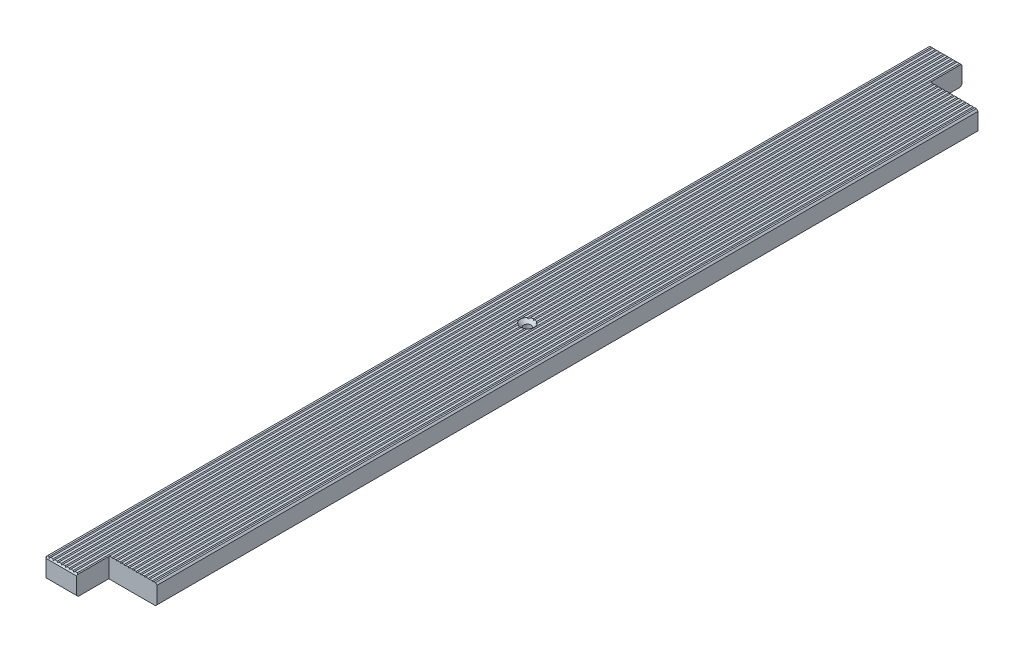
from build123d import *

# Parameters (mm, degrees)
ESQUISSE1_W                                    = 100
ESQUISSE1_H                                    = 25
BOSS_EXTRU_1_DEPTH                             = 550
CHANFREIN1_SIZE                                = 2
ENL_V_MAT_EXTRU_1_DEPTH                        = 1102.206724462
R_P_TITION_LIN_AIRE1_COUNT                     = 19
R_P_TITION_LIN_AIRE1_PITCH                     = 5
FRAISAGE_POUR_VIS_T_TE_FRAIS_E_M81_D           = 9
FRAISAGE_POUR_VIS_T_TE_FRAIS_E_M81_CSINK_D     = 17.3
FRAISAGE_POUR_VIS_T_TE_FRAIS_E_M81_CSINK_ANGLE = 90
ESQUISSE5_W                                    = 60
ESQUISSE5_H                                    = 40
ENL_V_MAT_EXTRU_2_DEPTH                        = 553.833609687


with BuildPart() as part:
    # Esquisse1 → Boss.-Extru.1 (new, symmetric)
    with BuildSketch(Plane.XY):
        Rectangle(ESQUISSE1_W, ESQUISSE1_H)
    extrude(amount=BOSS_EXTRU_1_DEPTH, both=True)

    # Chanfrein1
    chanfrein1_edges = [part.edges().sort_by_distance(p)[0] for p in [
        (-50, 0, 550),
        (0, -12.5, 550),
        (50, 0, 550),
        (0, -12.5, -550),
        (-50, 0, -550),
        (0, 12.5, -550),
        (50, 0, -550),
        (0, 12.5, 550),
        (50, -12.5, 0),
        (-50, -12.5, 0),
        (-50, 12.5, 0),
        (50, 12.5, 0),
    ]]
    chamfer(chanfrein1_edges, length=CHANFREIN1_SIZE)

    # Esquisse2 → Enl_v. mat.-Extru.1 (cut, through all)
    with BuildSketch(Plane.XY.offset(550)):
        Polygon((-46, 12.5), (-44, 12.5), (-45, 11.5), align=None)
    enl_v_mat_extru_1 = extrude(amount=-ENL_V_MAT_EXTRU_1_DEPTH, mode=Mode.SUBTRACT)

    # R_p_tition lin_aire1: Enl_v. mat.-Extru.1 ×19
    with Locations(*[(i * R_P_TITION_LIN_AIRE1_PITCH, 0, 0) for i in range(1, R_P_TITION_LIN_AIRE1_COUNT)]):
        add(enl_v_mat_extru_1, mode=Mode.SUBTRACT)

    # Fraisage pour vis _ t_te frais_e M81 (through all)
    with Locations(Plane(origin=(0, 12.5, 0), x_dir=(-1, 0, 0), z_dir=(0, 1, 0))):
        with Locations((0, -520), (0, 0), (0, 520)):
            CounterSinkHole(FRAISAGE_POUR_VIS_T_TE_FRAIS_E_M81_D / 2, FRAISAGE_POUR_VIS_T_TE_FRAIS_E_M81_CSINK_D / 2, counter_sink_angle=FRAISAGE_POUR_VIS_T_TE_FRAIS_E_M81_CSINK_ANGLE)

    # Esquisse5 → Enl_v. mat.-Extru.2 (cut, through all)
    with BuildSketch(Plane(origin=(0, 12.5, 0), x_dir=(1, 0, 0), z_dir=(0, 1, 0))):
        with Locations((20, -530)):
            Rectangle(ESQUISSE5_W, ESQUISSE5_H)
        with Locations((20, 530)):
            Rectangle(ESQUISSE5_W, ESQUISSE5_H)
    extrude(amount=-ENL_V_MAT_EXTRU_2_DEPTH, mode=Mode.SUBTRACT)


solid = part.part
